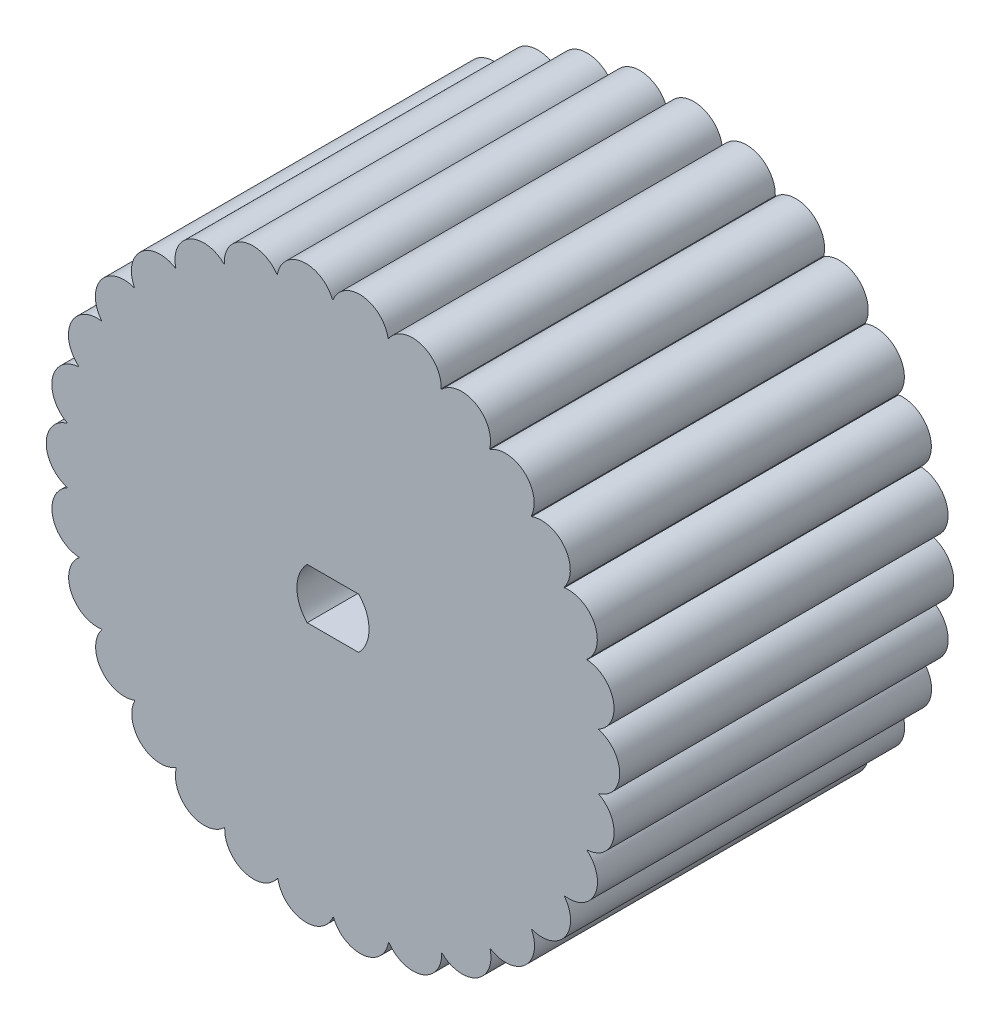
from build123d import *

# Parameters (mm, degrees)
SALIENTE_EXTRUIR1_DEPTH = 25


with BuildPart() as part:
    # Croquis1 → Saliente-Extruir1 (new body)
    with BuildSketch(Plane.XY):
        with BuildLine():
            ThreePointArc((0, 20), (-0.01876511, 19.999991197), (-0.037530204, 19.999964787))
            ThreePointArc((-0.037530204, 19.999964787), (-2.262966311, 21.338079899), (-4.158233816, 19.562952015))
            ThreePointArc((-4.158233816, 19.562952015), (-4.176587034, 19.559041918), (-4.194936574, 19.555114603))
            ThreePointArc((-4.194936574, 19.555114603), (-6.649951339, 20.401294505), (-8.134732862, 18.270909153))
            ThreePointArc((-8.134732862, 18.270909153), (-8.151872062, 18.263268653), (-8.169004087, 18.255612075))
            ThreePointArc((-8.169004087, 18.255612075), (-10.746301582, 18.572874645), (-11.755705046, 16.180339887))
            ThreePointArc((-11.755705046, 16.180339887), (-11.770881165, 16.16930291), (-11.786046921, 16.158251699))
            ThreePointArc((-11.786046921, 16.158251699), (-14.37298688, 15.932731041), (-14.86289651, 13.382612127))
            ThreePointArc((-14.86289651, 13.382612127), (-14.875446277, 13.368661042), (-14.887982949, 13.354698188))
            ThreePointArc((-14.887982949, 13.354698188), (-17.371503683, 12.596250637), (-17.320508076, 10))
            ThreePointArc((-17.320508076, 10), (-17.329883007, 9.983744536), (-17.339242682, 9.967480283))
            ThreePointArc((-17.339242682, 9.967480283), (-19.610802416, 8.709253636), (-19.021130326, 6.180339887))
            ThreePointArc((-19.021130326, 6.180339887), (-19.026920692, 6.162490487), (-19.032694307, 6.144635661))
            ThreePointArc((-19.032694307, 6.144635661), (-20.993014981, 4.441620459), (-19.890437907, 2.090569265))
            ThreePointArc((-19.890437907, 2.090569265), (-19.89239064, 2.071906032), (-19.894325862, 2.053240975))
            ThreePointArc((-19.894325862, 2.053240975), (-21.457732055, -0.020132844), (-19.890437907, -2.090569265))
            ThreePointArc((-19.890437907, -2.090569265), (-19.888467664, -2.109230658), (-19.886479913, -2.127890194))
            ThreePointArc((-19.886479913, -2.127890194), (-20.984643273, -4.481006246), (-19.021130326, -6.180339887))
            ThreePointArc((-19.021130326, -6.180339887), (-19.015323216, -6.198183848), (-19.009499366, -6.216022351))
            ThreePointArc((-19.009499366, -6.216022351), (-19.594424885, -8.746038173), (-17.320508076, -10))
            ThreePointArc((-17.320508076, -10), (-17.311117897, -10.016246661), (-17.301712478, -10.032484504))
            ThreePointArc((-17.301712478, -10.032484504), (-17.347836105, -12.628826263), (-14.86289651, -13.382612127))
            ThreePointArc((-14.86289651, -13.382612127), (-14.850333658, -13.396551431), (-14.837757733, -13.410478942))
            ThreePointArc((-14.837757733, -13.410478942), (-14.343063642, -15.959674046), (-11.755705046, -16.180339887))
            ThreePointArc((-11.755705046, -16.180339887), (-11.740518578, -16.191362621), (-11.725321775, -16.2023711))
            ThreePointArc((-11.725321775, -16.2023711), (-10.711430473, -18.59300749), (-8.134732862, -18.270909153))
            ThreePointArc((-8.134732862, -18.270909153), (-8.1175865, -18.278533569), (-8.100432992, -18.286141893))
            ThreePointArc((-8.100432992, -18.286141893), (-6.611656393, -20.413737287), (-4.158233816, -19.562952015))
            ThreePointArc((-4.158233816, -19.562952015), (-4.139876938, -19.56684489), (-4.121516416, -19.570720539))
            ThreePointArc((-4.121516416, -19.570720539), (-2.222921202, -21.342288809), (0, -20))
            ThreePointArc((0, -20), (0.01876511, -19.999991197), (0.037530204, -19.999964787))
            ThreePointArc((0.037530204, -19.999964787), (2.262966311, -21.338079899), (4.158233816, -19.562952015))
            ThreePointArc((4.158233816, -19.562952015), (4.176587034, -19.559041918), (4.194936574, -19.555114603))
            ThreePointArc((4.194936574, -19.555114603), (6.649951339, -20.401294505), (8.134732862, -18.270909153))
            ThreePointArc((8.134732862, -18.270909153), (8.151872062, -18.263268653), (8.169004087, -18.255612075))
            ThreePointArc((8.169004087, -18.255612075), (10.746301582, -18.572874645), (11.755705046, -16.180339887))
            ThreePointArc((11.755705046, -16.180339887), (11.770881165, -16.16930291), (11.786046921, -16.158251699))
            ThreePointArc((11.786046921, -16.158251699), (14.37298688, -15.932731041), (14.86289651, -13.382612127))
            ThreePointArc((14.86289651, -13.382612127), (14.875446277, -13.368661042), (14.887982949, -13.354698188))
            ThreePointArc((14.887982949, -13.354698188), (17.371503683, -12.596250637), (17.320508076, -10))
            ThreePointArc((17.320508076, -10), (17.329883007, -9.983744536), (17.339242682, -9.967480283))
            ThreePointArc((17.339242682, -9.967480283), (19.610802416, -8.709253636), (19.021130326, -6.180339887))
            ThreePointArc((19.021130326, -6.180339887), (19.026920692, -6.162490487), (19.032694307, -6.144635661))
            ThreePointArc((19.032694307, -6.144635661), (20.993014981, -4.441620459), (19.890437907, -2.090569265))
            ThreePointArc((19.890437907, -2.090569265), (19.89239064, -2.071906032), (19.894325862, -2.053240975))
            ThreePointArc((19.894325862, -2.053240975), (21.457732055, 0.020132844), (19.890437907, 2.090569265))
            ThreePointArc((19.890437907, 2.090569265), (19.888467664, 2.109230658), (19.886479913, 2.127890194))
            ThreePointArc((19.886479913, 2.127890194), (20.984643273, 4.481006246), (19.021130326, 6.180339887))
            ThreePointArc((19.021130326, 6.180339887), (19.015323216, 6.198183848), (19.009499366, 6.216022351))
            ThreePointArc((19.009499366, 6.216022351), (19.594424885, 8.746038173), (17.320508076, 10))
            ThreePointArc((17.320508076, 10), (17.311117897, 10.016246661), (17.301712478, 10.032484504))
            ThreePointArc((17.301712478, 10.032484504), (17.347836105, 12.628826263), (14.86289651, 13.382612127))
            ThreePointArc((14.86289651, 13.382612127), (14.850333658, 13.396551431), (14.837757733, 13.410478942))
            ThreePointArc((14.837757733, 13.410478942), (14.343063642, 15.959674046), (11.755705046, 16.180339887))
            ThreePointArc((11.755705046, 16.180339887), (11.740518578, 16.191362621), (11.725321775, 16.2023711))
            ThreePointArc((11.725321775, 16.2023711), (10.711430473, 18.59300749), (8.134732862, 18.270909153))
            ThreePointArc((8.134732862, 18.270909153), (8.1175865, 18.278533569), (8.100432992, 18.286141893))
            ThreePointArc((8.100432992, 18.286141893), (6.611656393, 20.413737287), (4.158233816, 19.562952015))
            ThreePointArc((4.158233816, 19.562952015), (4.139876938, 19.56684489), (4.121516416, 19.570720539))
            ThreePointArc((4.121516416, 19.570720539), (2.222921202, 21.342288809), (0, 20))
        make_face()
        with BuildLine():
            Line((-1.928185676, -1.89), (1.928185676, -1.89))
            ThreePointArc((1.928185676, -1.89), (2.7, 0), (1.928185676, 1.89))
            Line((1.928185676, 1.89), (-1.928185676, 1.89))
            ThreePointArc((-1.928185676, 1.89), (-2.7, 0), (-1.928185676, -1.89))
        make_face(mode=Mode.SUBTRACT)
    extrude(amount=SALIENTE_EXTRUIR1_DEPTH)


solid = part.part
